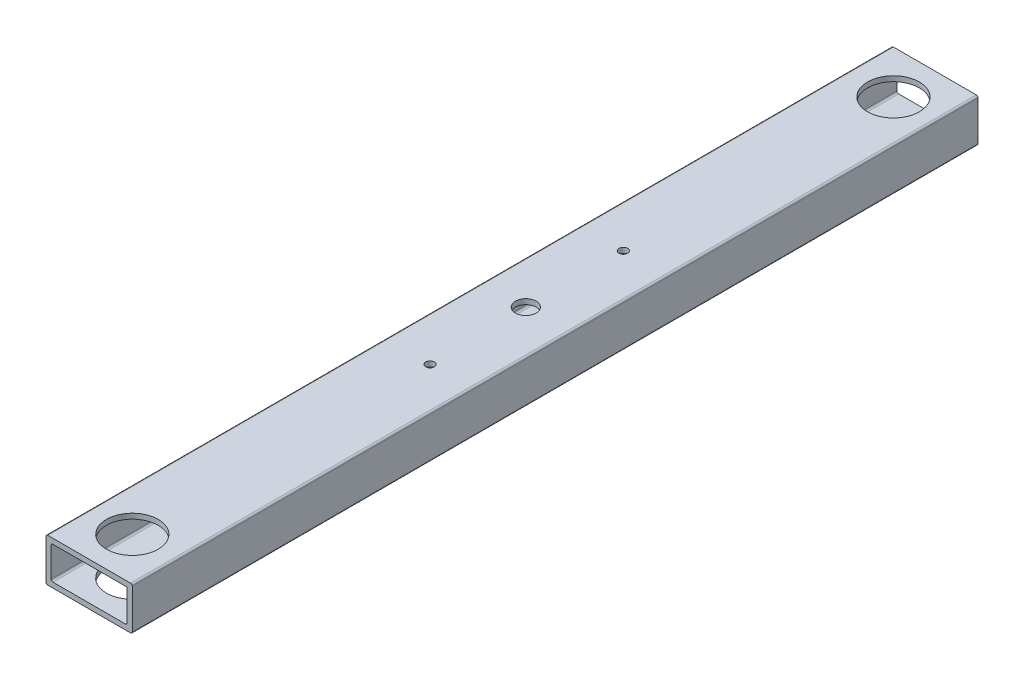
from build123d import *

# Parameters (mm, degrees)
EXTRUSION1_DEPTH        = 490
ESQUISSE2_R             = 15
ESQUISSE2_R_2           = 6
ENL_V_MAT_EXTRU_1_DEPTH = 494.178466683
TROU_TARAUD_M61_D       = 5
TROU_TARAUD_M61_DEPTH   = 15
TROU_TARAUD_M61_TIP     = 1.502151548


with BuildPart() as part:
    # Esquisse1 → Extrusion1 (new body)
    with BuildSketch(Plane.XY):
        with BuildLine():
            Line((1, 0), (49, 0))
            ThreePointArc((49, 0), (49.707106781, 0.292893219), (50, 1))
            Line((50, 1), (50, 24))
            ThreePointArc((50, 24), (49.707106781, 24.707106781), (49, 25))
            Line((49, 25), (1, 25))
            ThreePointArc((1, 25), (0.292893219, 24.707106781), (0, 24))
            Line((0, 24), (0, 1))
            ThreePointArc((0, 1), (0.292893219, 0.292893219), (1, 0))
        make_face()
        with BuildLine():
            Line((3, 4), (3, 21))
            ThreePointArc((3, 21), (3.292893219, 21.707106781), (4, 22))
            Line((4, 22), (47, 22))
            Line((47, 22), (47, 4))
            ThreePointArc((47, 4), (46.707106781, 3.292893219), (46, 3))
            Line((46, 3), (4, 3))
            ThreePointArc((4, 3), (3.292893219, 3.292893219), (3, 4))
        make_face(mode=Mode.SUBTRACT)
    extrude(amount=EXTRUSION1_DEPTH)

    # Esquisse2 → Enl_v. mat.-Extru.1 (cut, through all)
    with BuildSketch(Plane(origin=(0, 25, 0), x_dir=(-1, 0, 0), z_dir=(0, 1, 0))):
        with Locations(Location((-26, 25, 0), (0, 0, 90))):
            Circle(ESQUISSE2_R)
        with Locations(Location((-25, 237, 0), (0, 0, 90))):
            Circle(ESQUISSE2_R_2)
        with Locations(Location((-25, 465, 0), (0, 0, 90))):
            Circle(ESQUISSE2_R)
    extrude(amount=-ENL_V_MAT_EXTRU_1_DEPTH, mode=Mode.SUBTRACT)

    # Trou taraud_ M61
    with Locations(Plane(origin=(0, 25, 0), x_dir=(-1, 0, 0), z_dir=(0, 1, 0))):
        with Locations((-25, 180.5), (-26, 293.495575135)):
            Hole(TROU_TARAUD_M61_D / 2, depth=TROU_TARAUD_M61_DEPTH)
            with Locations((0, 0, -(TROU_TARAUD_M61_DEPTH + TROU_TARAUD_M61_TIP / 2))):  # 118° drill point
                Cone(0, TROU_TARAUD_M61_D / 2, TROU_TARAUD_M61_TIP, mode=Mode.SUBTRACT)


solid = part.part
